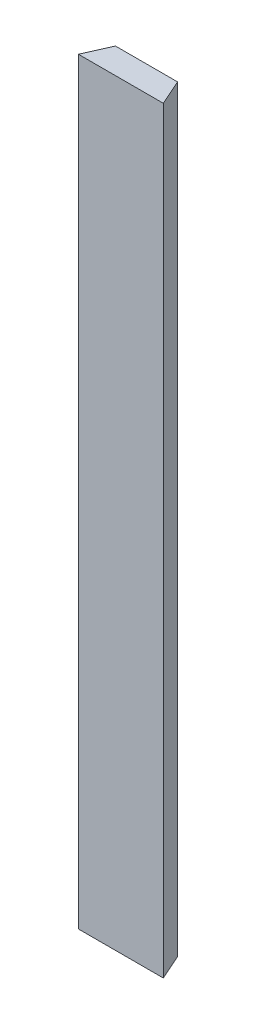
ISO-10303-21;
HEADER;
FILE_DESCRIPTION(('STEP AP214'),'2;1');
FILE_NAME('part.step','',(''),(''),'','','');
FILE_SCHEMA(('AUTOMOTIVE_DESIGN { 1 0 10303 214 1 1 1 1 }'));
ENDSEC;
DATA;
#1=APPLICATION_CONTEXT('core data for automotive mechanical design processes');
#2=APPLICATION_PROTOCOL_DEFINITION('international standard','automotive_design',2000,#1);
#3=PRODUCT_CONTEXT('',#1,'mechanical');
#4=PRODUCT('Part','Part','',(#3));
#5=PRODUCT_RELATED_PRODUCT_CATEGORY('part','',(#4));
#6=PRODUCT_DEFINITION_FORMATION('','',#4);
#7=PRODUCT_DEFINITION_CONTEXT('part definition',#1,'design');
#8=PRODUCT_DEFINITION('design','',#6,#7);
#9=PRODUCT_DEFINITION_SHAPE('','',#8);
#10=(LENGTH_UNIT() NAMED_UNIT(*) SI_UNIT(.MILLI.,.METRE.));
#11=(NAMED_UNIT(*) PLANE_ANGLE_UNIT() SI_UNIT($,.RADIAN.));
#12=(NAMED_UNIT(*) SI_UNIT($,.STERADIAN.) SOLID_ANGLE_UNIT());
#13=UNCERTAINTY_MEASURE_WITH_UNIT(LENGTH_MEASURE(1.E-05),#10,'distance_accuracy_value','');
#14=(GEOMETRIC_REPRESENTATION_CONTEXT(3) GLOBAL_UNCERTAINTY_ASSIGNED_CONTEXT((#13)) GLOBAL_UNIT_ASSIGNED_CONTEXT((#10,
#11,#12)) REPRESENTATION_CONTEXT('',''));
#15=CARTESIAN_POINT('',(0.,0.,0.));
#16=DIRECTION('',(0.,0.,1.));
#17=DIRECTION('',(1.,0.,0.));
#18=AXIS2_PLACEMENT_3D('',#15,#16,#17);
#19=CARTESIAN_POINT('',(18.25625,1219.2,-41.275));
#20=DIRECTION('',(0.914535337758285,0.,0.404506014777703));
#21=DIRECTION('',(0.404506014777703,0.,-0.914535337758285));
#22=AXIS2_PLACEMENT_3D('',#19,#20,#21);
#23=PLANE('',#22);
#24=DIRECTION('',(-0.404506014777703,0.,0.914535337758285));
#25=VECTOR('',#24,1.);
#26=CARTESIAN_POINT('',(18.25625,0.,-41.275));
#27=LINE('',#26,#25);
#28=CARTESIAN_POINT('',(18.25625,0.,-41.275));
#29=VERTEX_POINT('',#28);
#30=CARTESIAN_POINT('',(0.,0.,0.));
#31=VERTEX_POINT('',#30);
#32=EDGE_CURVE('E95',#29,#31,#27,.T.);
#33=ORIENTED_EDGE('',*,*,#32,.T.);
#34=DIRECTION('',(0.,-1.,0.));
#35=VECTOR('',#34,1.);
#36=CARTESIAN_POINT('',(0.,1219.2,0.));
#37=LINE('',#36,#35);
#38=CARTESIAN_POINT('',(0.,1219.2,0.));
#39=VERTEX_POINT('',#38);
#40=EDGE_CURVE('E11',#39,#31,#37,.T.);
#41=ORIENTED_EDGE('',*,*,#40,.F.);
#42=DIRECTION('',(-0.404506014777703,0.,0.914535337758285));
#43=VECTOR('',#42,1.);
#44=CARTESIAN_POINT('',(18.25625,1219.2,-41.275));
#45=LINE('',#44,#43);
#46=CARTESIAN_POINT('',(18.25625,1219.2,-41.275));
#47=VERTEX_POINT('',#46);
#48=EDGE_CURVE('E83',#47,#39,#45,.T.);
#49=ORIENTED_EDGE('',*,*,#48,.F.);
#50=DIRECTION('',(0.,-1.,0.));
#51=VECTOR('',#50,1.);
#52=CARTESIAN_POINT('',(18.25625,1219.2,-41.275));
#53=LINE('',#52,#51);
#54=EDGE_CURVE('E91',#47,#29,#53,.T.);
#55=ORIENTED_EDGE('',*,*,#54,.T.);
#56=EDGE_LOOP('',(#33,#41,#49,#55));
#57=FACE_BOUND('',#56,.T.);
#58=ADVANCED_FACE('F32',(#57),#23,.F.);
#59=CARTESIAN_POINT('',(0.,1219.2,0.));
#60=DIRECTION('',(0.,0.,-1.));
#61=DIRECTION('',(-1.,0.,0.));
#62=AXIS2_PLACEMENT_3D('',#59,#60,#61);
#63=PLANE('',#62);
#64=DIRECTION('',(1.,0.,0.));
#65=VECTOR('',#64,1.);
#66=CARTESIAN_POINT('',(0.,0.,0.));
#67=LINE('',#66,#65);
#68=CARTESIAN_POINT('',(136.525,0.,0.));
#69=VERTEX_POINT('',#68);
#70=EDGE_CURVE('E87',#31,#69,#67,.T.);
#71=ORIENTED_EDGE('',*,*,#70,.T.);
#72=DIRECTION('',(0.,-1.,0.));
#73=VECTOR('',#72,1.);
#74=CARTESIAN_POINT('',(136.525,1219.2,0.));
#75=LINE('',#74,#73);
#76=CARTESIAN_POINT('',(136.525,1219.2,0.));
#77=VERTEX_POINT('',#76);
#78=EDGE_CURVE('E40',#77,#69,#75,.T.);
#79=ORIENTED_EDGE('',*,*,#78,.F.);
#80=DIRECTION('',(1.,0.,0.));
#81=VECTOR('',#80,1.);
#82=CARTESIAN_POINT('',(0.,1219.2,0.));
#83=LINE('',#82,#81);
#84=EDGE_CURVE('E78',#39,#77,#83,.T.);
#85=ORIENTED_EDGE('',*,*,#84,.F.);
#86=ORIENTED_EDGE('',*,*,#40,.T.);
#87=EDGE_LOOP('',(#71,#79,#85,#86));
#88=FACE_BOUND('',#87,.T.);
#89=ADVANCED_FACE('F86',(#88),#63,.F.);
#90=CARTESIAN_POINT('',(136.525,1219.2,0.));
#91=DIRECTION('',(-0.914535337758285,0.,0.404506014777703));
#92=DIRECTION('',(0.404506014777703,0.,0.914535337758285));
#93=AXIS2_PLACEMENT_3D('',#90,#91,#92);
#94=PLANE('',#93);
#95=DIRECTION('',(-0.404506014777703,0.,-0.914535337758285));
#96=VECTOR('',#95,1.);
#97=CARTESIAN_POINT('',(136.525,0.,0.));
#98=LINE('',#97,#96);
#99=CARTESIAN_POINT('',(118.26875,0.,-41.275));
#100=VERTEX_POINT('',#99);
#101=EDGE_CURVE('E65',#69,#100,#98,.T.);
#102=ORIENTED_EDGE('',*,*,#101,.T.);
#103=DIRECTION('',(0.,-1.,0.));
#104=VECTOR('',#103,1.);
#105=CARTESIAN_POINT('',(118.26875,1219.2,-41.275));
#106=LINE('',#105,#104);
#107=CARTESIAN_POINT('',(118.26875,1219.2,-41.275));
#108=VERTEX_POINT('',#107);
#109=EDGE_CURVE('E88',#108,#100,#106,.T.);
#110=ORIENTED_EDGE('',*,*,#109,.F.);
#111=DIRECTION('',(-0.404506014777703,0.,-0.914535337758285));
#112=VECTOR('',#111,1.);
#113=CARTESIAN_POINT('',(136.525,1219.2,0.));
#114=LINE('',#113,#112);
#115=EDGE_CURVE('E81',#77,#108,#114,.T.);
#116=ORIENTED_EDGE('',*,*,#115,.F.);
#117=ORIENTED_EDGE('',*,*,#78,.T.);
#118=EDGE_LOOP('',(#102,#110,#116,#117));
#119=FACE_BOUND('',#118,.T.);
#120=ADVANCED_FACE('F89',(#119),#94,.F.);
#121=CARTESIAN_POINT('',(118.26875,1219.2,-41.275));
#122=DIRECTION('',(0.,0.,1.));
#123=DIRECTION('',(1.,0.,0.));
#124=AXIS2_PLACEMENT_3D('',#121,#122,#123);
#125=PLANE('',#124);
#126=DIRECTION('',(-1.,0.,0.));
#127=VECTOR('',#126,1.);
#128=CARTESIAN_POINT('',(118.26875,0.,-41.275));
#129=LINE('',#128,#127);
#130=EDGE_CURVE('E71',#100,#29,#129,.T.);
#131=ORIENTED_EDGE('',*,*,#130,.T.);
#132=ORIENTED_EDGE('',*,*,#54,.F.);
#133=DIRECTION('',(-1.,0.,0.));
#134=VECTOR('',#133,1.);
#135=CARTESIAN_POINT('',(118.26875,1219.2,-41.275));
#136=LINE('',#135,#134);
#137=EDGE_CURVE('E48',#108,#47,#136,.T.);
#138=ORIENTED_EDGE('',*,*,#137,.F.);
#139=ORIENTED_EDGE('',*,*,#109,.T.);
#140=EDGE_LOOP('',(#131,#132,#138,#139));
#141=FACE_BOUND('',#140,.T.);
#142=ADVANCED_FACE('F102',(#141),#125,.F.);
#143=CARTESIAN_POINT('',(0.,1219.2,0.));
#144=DIRECTION('',(0.,1.,0.));
#145=DIRECTION('',(0.,0.,1.));
#146=AXIS2_PLACEMENT_3D('',#143,#144,#145);
#147=PLANE('',#146);
#148=ORIENTED_EDGE('',*,*,#48,.T.);
#149=ORIENTED_EDGE('',*,*,#84,.T.);
#150=ORIENTED_EDGE('',*,*,#115,.T.);
#151=ORIENTED_EDGE('',*,*,#137,.T.);
#152=EDGE_LOOP('',(#148,#149,#150,#151));
#153=FACE_BOUND('',#152,.T.);
#154=ADVANCED_FACE('F79',(#153),#147,.T.);
#155=CARTESIAN_POINT('',(0.,0.,0.));
#156=DIRECTION('',(0.,1.,0.));
#157=DIRECTION('',(0.,0.,1.));
#158=AXIS2_PLACEMENT_3D('',#155,#156,#157);
#159=PLANE('',#158);
#160=ORIENTED_EDGE('',*,*,#32,.F.);
#161=ORIENTED_EDGE('',*,*,#130,.F.);
#162=ORIENTED_EDGE('',*,*,#101,.F.);
#163=ORIENTED_EDGE('',*,*,#70,.F.);
#164=EDGE_LOOP('',(#160,#161,#162,#163));
#165=FACE_BOUND('',#164,.T.);
#166=ADVANCED_FACE('F105',(#165),#159,.F.);
#167=CLOSED_SHELL('',(#58,#89,#120,#142,#154,#166));
#168=MANIFOLD_SOLID_BREP('B2',#167);
#169=ADVANCED_BREP_SHAPE_REPRESENTATION('',(#18,#168),#14);
#170=SHAPE_DEFINITION_REPRESENTATION(#9,#169);
ENDSEC;
END-ISO-10303-21;
